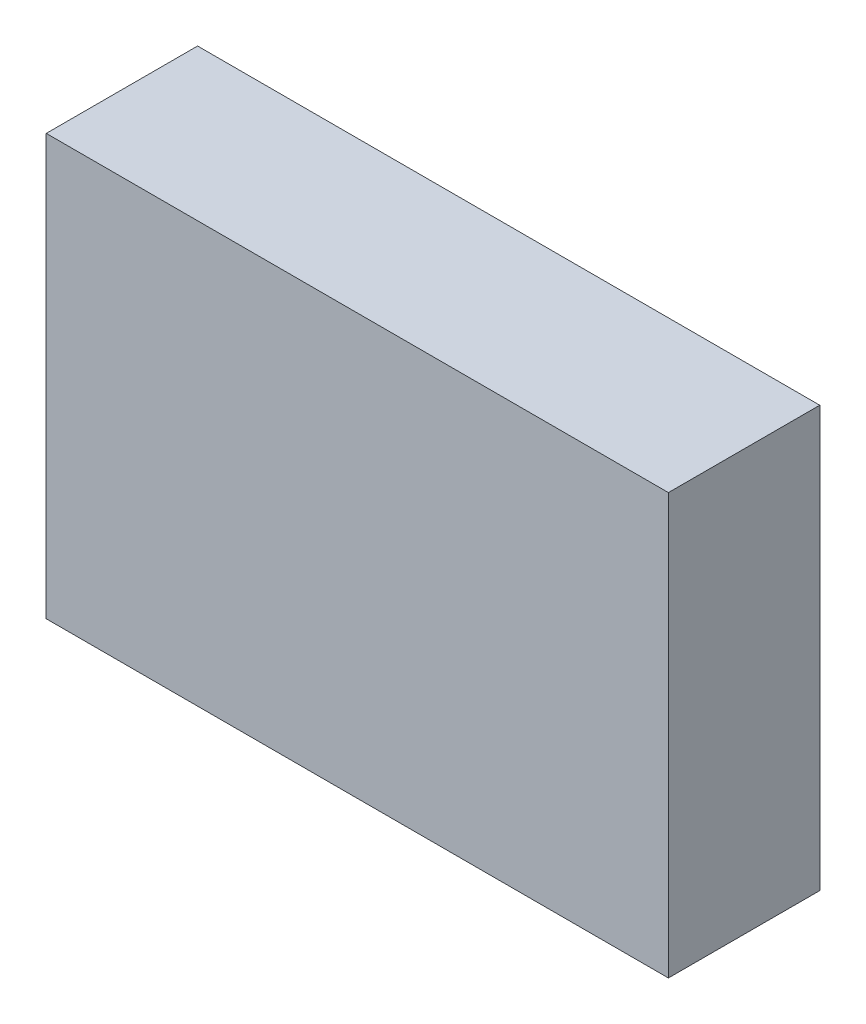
ISO-10303-21;
HEADER;
FILE_DESCRIPTION(('STEP AP214'),'2;1');
FILE_NAME('part.step','',(''),(''),'','','');
FILE_SCHEMA(('AUTOMOTIVE_DESIGN { 1 0 10303 214 1 1 1 1 }'));
ENDSEC;
DATA;
#1=APPLICATION_CONTEXT('core data for automotive mechanical design processes');
#2=APPLICATION_PROTOCOL_DEFINITION('international standard','automotive_design',2000,#1);
#3=PRODUCT_CONTEXT('',#1,'mechanical');
#4=PRODUCT('Part','Part','',(#3));
#5=PRODUCT_RELATED_PRODUCT_CATEGORY('part','',(#4));
#6=PRODUCT_DEFINITION_FORMATION('','',#4);
#7=PRODUCT_DEFINITION_CONTEXT('part definition',#1,'design');
#8=PRODUCT_DEFINITION('design','',#6,#7);
#9=PRODUCT_DEFINITION_SHAPE('','',#8);
#10=(LENGTH_UNIT() NAMED_UNIT(*) SI_UNIT(.MILLI.,.METRE.));
#11=(NAMED_UNIT(*) PLANE_ANGLE_UNIT() SI_UNIT($,.RADIAN.));
#12=(NAMED_UNIT(*) SI_UNIT($,.STERADIAN.) SOLID_ANGLE_UNIT());
#13=UNCERTAINTY_MEASURE_WITH_UNIT(LENGTH_MEASURE(1.E-05),#10,'distance_accuracy_value','');
#14=(GEOMETRIC_REPRESENTATION_CONTEXT(3) GLOBAL_UNCERTAINTY_ASSIGNED_CONTEXT((#13)) GLOBAL_UNIT_ASSIGNED_CONTEXT((#10,
#11,#12)) REPRESENTATION_CONTEXT('',''));
#15=CARTESIAN_POINT('',(0.,0.,0.));
#16=DIRECTION('',(0.,0.,1.));
#17=DIRECTION('',(1.,0.,0.));
#18=AXIS2_PLACEMENT_3D('',#15,#16,#17);
#19=CARTESIAN_POINT('',(1.84999878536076,1.25000012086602,0.));
#20=DIRECTION('',(0.999999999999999,4.37113882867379E-08,0.));
#21=DIRECTION('',(4.37113882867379E-08,-0.999999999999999,0.));
#22=AXIS2_PLACEMENT_3D('',#19,#20,#21);
#23=PLANE('',#22);
#24=DIRECTION('',(0.,0.,1.));
#25=VECTOR('',#24,1.);
#26=CARTESIAN_POINT('',(1.84999878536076,1.25000012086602,0.));
#27=LINE('',#26,#25);
#28=CARTESIAN_POINT('',(1.84999878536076,1.25000012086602,0.));
#29=VERTEX_POINT('',#28);
#30=CARTESIAN_POINT('',(1.84999878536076,1.25000012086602,0.90000074));
#31=VERTEX_POINT('',#30);
#32=EDGE_CURVE('E11',#29,#31,#27,.T.);
#33=ORIENTED_EDGE('',*,*,#32,.T.);
#34=DIRECTION('',(4.37113882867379E-08,-0.999999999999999,0.));
#35=VECTOR('',#34,1.);
#36=CARTESIAN_POINT('',(1.84999878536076,1.25000012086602,0.90000074));
#37=LINE('',#36,#35);
#38=CARTESIAN_POINT('',(1.84999889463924,-1.24999995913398,0.90000074));
#39=VERTEX_POINT('',#38);
#40=EDGE_CURVE('E24',#31,#39,#37,.T.);
#41=ORIENTED_EDGE('',*,*,#40,.T.);
#42=DIRECTION('',(0.,0.,1.));
#43=VECTOR('',#42,1.);
#44=CARTESIAN_POINT('',(1.84999889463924,-1.24999995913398,0.));
#45=LINE('',#44,#43);
#46=CARTESIAN_POINT('',(1.84999889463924,-1.24999995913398,0.));
#47=VERTEX_POINT('',#46);
#48=EDGE_CURVE('E84',#47,#39,#45,.T.);
#49=ORIENTED_EDGE('',*,*,#48,.F.);
#50=DIRECTION('',(4.37113882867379E-08,-0.999999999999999,0.));
#51=VECTOR('',#50,1.);
#52=CARTESIAN_POINT('',(1.84999878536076,1.25000012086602,0.));
#53=LINE('',#52,#51);
#54=EDGE_CURVE('E82',#29,#47,#53,.T.);
#55=ORIENTED_EDGE('',*,*,#54,.F.);
#56=EDGE_LOOP('',(#33,#41,#49,#55));
#57=FACE_BOUND('',#56,.T.);
#58=ADVANCED_FACE('F17',(#57),#23,.T.);
#59=CARTESIAN_POINT('',(1.84999889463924,-1.24999995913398,0.));
#60=DIRECTION('',(4.37113882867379E-08,-0.999999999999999,0.));
#61=DIRECTION('',(-0.999999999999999,-4.37113882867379E-08,0.));
#62=AXIS2_PLACEMENT_3D('',#59,#60,#61);
#63=PLANE('',#62);
#64=ORIENTED_EDGE('',*,*,#48,.T.);
#65=DIRECTION('',(-0.999999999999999,-4.37113882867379E-08,0.));
#66=VECTOR('',#65,1.);
#67=CARTESIAN_POINT('',(1.84999889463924,-1.24999995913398,0.90000074));
#68=LINE('',#67,#66);
#69=CARTESIAN_POINT('',(-1.84999878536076,-1.25000012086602,0.90000074));
#70=VERTEX_POINT('',#69);
#71=EDGE_CURVE('E79',#39,#70,#68,.T.);
#72=ORIENTED_EDGE('',*,*,#71,.T.);
#73=DIRECTION('',(0.,0.,1.));
#74=VECTOR('',#73,1.);
#75=CARTESIAN_POINT('',(-1.84999878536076,-1.25000012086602,0.));
#76=LINE('',#75,#74);
#77=CARTESIAN_POINT('',(-1.84999878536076,-1.25000012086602,0.));
#78=VERTEX_POINT('',#77);
#79=EDGE_CURVE('E77',#78,#70,#76,.T.);
#80=ORIENTED_EDGE('',*,*,#79,.F.);
#81=DIRECTION('',(-0.999999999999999,-4.37113882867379E-08,0.));
#82=VECTOR('',#81,1.);
#83=CARTESIAN_POINT('',(1.84999889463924,-1.24999995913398,0.));
#84=LINE('',#83,#82);
#85=EDGE_CURVE('E67',#47,#78,#84,.T.);
#86=ORIENTED_EDGE('',*,*,#85,.F.);
#87=EDGE_LOOP('',(#64,#72,#80,#86));
#88=FACE_BOUND('',#87,.T.);
#89=ADVANCED_FACE('F90',(#88),#63,.T.);
#90=CARTESIAN_POINT('',(-1.84999878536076,-1.25000012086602,0.));
#91=DIRECTION('',(-0.999999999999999,-4.37113882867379E-08,0.));
#92=DIRECTION('',(-4.37113882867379E-08,0.999999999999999,0.));
#93=AXIS2_PLACEMENT_3D('',#90,#91,#92);
#94=PLANE('',#93);
#95=ORIENTED_EDGE('',*,*,#79,.T.);
#96=DIRECTION('',(-4.37113882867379E-08,0.999999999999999,0.));
#97=VECTOR('',#96,1.);
#98=CARTESIAN_POINT('',(-1.84999878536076,-1.25000012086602,0.90000074));
#99=LINE('',#98,#97);
#100=CARTESIAN_POINT('',(-1.84999889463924,1.24999995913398,0.90000074));
#101=VERTEX_POINT('',#100);
#102=EDGE_CURVE('E59',#70,#101,#99,.T.);
#103=ORIENTED_EDGE('',*,*,#102,.T.);
#104=DIRECTION('',(0.,0.,1.));
#105=VECTOR('',#104,1.);
#106=CARTESIAN_POINT('',(-1.84999889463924,1.24999995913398,0.));
#107=LINE('',#106,#105);
#108=CARTESIAN_POINT('',(-1.84999889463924,1.24999995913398,0.));
#109=VERTEX_POINT('',#108);
#110=EDGE_CURVE('E54',#109,#101,#107,.T.);
#111=ORIENTED_EDGE('',*,*,#110,.F.);
#112=DIRECTION('',(-4.37113882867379E-08,0.999999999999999,0.));
#113=VECTOR('',#112,1.);
#114=CARTESIAN_POINT('',(-1.84999878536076,-1.25000012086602,0.));
#115=LINE('',#114,#113);
#116=EDGE_CURVE('E58',#78,#109,#115,.T.);
#117=ORIENTED_EDGE('',*,*,#116,.F.);
#118=EDGE_LOOP('',(#95,#103,#111,#117));
#119=FACE_BOUND('',#118,.T.);
#120=ADVANCED_FACE('F57',(#119),#94,.T.);
#121=CARTESIAN_POINT('',(-1.84999889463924,1.24999995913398,0.));
#122=DIRECTION('',(-4.37113882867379E-08,0.999999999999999,0.));
#123=DIRECTION('',(0.999999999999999,4.37113882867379E-08,0.));
#124=AXIS2_PLACEMENT_3D('',#121,#122,#123);
#125=PLANE('',#124);
#126=ORIENTED_EDGE('',*,*,#110,.T.);
#127=DIRECTION('',(0.999999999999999,4.37113882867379E-08,0.));
#128=VECTOR('',#127,1.);
#129=CARTESIAN_POINT('',(-1.84999889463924,1.24999995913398,0.90000074));
#130=LINE('',#129,#128);
#131=EDGE_CURVE('E69',#101,#31,#130,.T.);
#132=ORIENTED_EDGE('',*,*,#131,.T.);
#133=ORIENTED_EDGE('',*,*,#32,.F.);
#134=DIRECTION('',(0.999999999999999,4.37113882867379E-08,0.));
#135=VECTOR('',#134,1.);
#136=CARTESIAN_POINT('',(-1.84999889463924,1.24999995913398,0.));
#137=LINE('',#136,#135);
#138=EDGE_CURVE('E66',#109,#29,#137,.T.);
#139=ORIENTED_EDGE('',*,*,#138,.F.);
#140=EDGE_LOOP('',(#126,#132,#133,#139));
#141=FACE_BOUND('',#140,.T.);
#142=ADVANCED_FACE('F71',(#141),#125,.T.);
#143=CARTESIAN_POINT('',(1.84999878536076,1.25000012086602,0.));
#144=DIRECTION('',(0.,0.,1.));
#145=DIRECTION('',(-4.37113882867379E-08,0.999999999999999,0.));
#146=AXIS2_PLACEMENT_3D('',#143,#144,#145);
#147=PLANE('',#146);
#148=ORIENTED_EDGE('',*,*,#54,.T.);
#149=ORIENTED_EDGE('',*,*,#85,.T.);
#150=ORIENTED_EDGE('',*,*,#116,.T.);
#151=ORIENTED_EDGE('',*,*,#138,.T.);
#152=EDGE_LOOP('',(#148,#149,#150,#151));
#153=FACE_BOUND('',#152,.T.);
#154=ADVANCED_FACE('F65',(#153),#147,.F.);
#155=CARTESIAN_POINT('',(1.84999878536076,1.25000012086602,0.90000074));
#156=DIRECTION('',(0.,0.,1.));
#157=DIRECTION('',(-4.37113882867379E-08,0.999999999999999,0.));
#158=AXIS2_PLACEMENT_3D('',#155,#156,#157);
#159=PLANE('',#158);
#160=ORIENTED_EDGE('',*,*,#131,.F.);
#161=ORIENTED_EDGE('',*,*,#102,.F.);
#162=ORIENTED_EDGE('',*,*,#71,.F.);
#163=ORIENTED_EDGE('',*,*,#40,.F.);
#164=EDGE_LOOP('',(#160,#161,#162,#163));
#165=FACE_BOUND('',#164,.T.);
#166=ADVANCED_FACE('F91',(#165),#159,.T.);
#167=CLOSED_SHELL('',(#58,#89,#120,#142,#154,#166));
#168=MANIFOLD_SOLID_BREP('B1',#167);
#169=ADVANCED_BREP_SHAPE_REPRESENTATION('',(#18,#168),#14);
#170=SHAPE_DEFINITION_REPRESENTATION(#9,#169);
ENDSEC;
END-ISO-10303-21;
